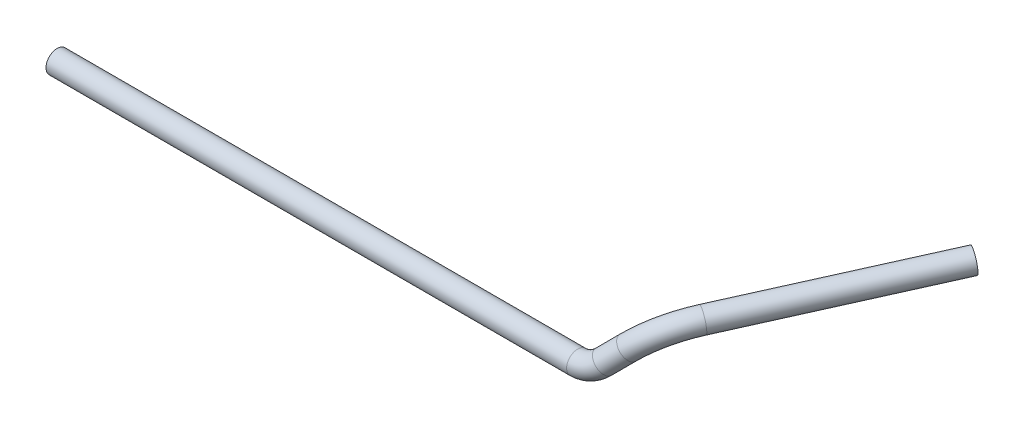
ISO-10303-21;
HEADER;
FILE_DESCRIPTION(('STEP AP214'),'2;1');
FILE_NAME('part.step','',(''),(''),'','','');
FILE_SCHEMA(('AUTOMOTIVE_DESIGN { 1 0 10303 214 1 1 1 1 }'));
ENDSEC;
DATA;
#1=APPLICATION_CONTEXT('core data for automotive mechanical design processes');
#2=APPLICATION_PROTOCOL_DEFINITION('international standard','automotive_design',2000,#1);
#3=PRODUCT_CONTEXT('',#1,'mechanical');
#4=PRODUCT('Part','Part','',(#3));
#5=PRODUCT_RELATED_PRODUCT_CATEGORY('part','',(#4));
#6=PRODUCT_DEFINITION_FORMATION('','',#4);
#7=PRODUCT_DEFINITION_CONTEXT('part definition',#1,'design');
#8=PRODUCT_DEFINITION('design','',#6,#7);
#9=PRODUCT_DEFINITION_SHAPE('','',#8);
#10=(LENGTH_UNIT() NAMED_UNIT(*) SI_UNIT(.MILLI.,.METRE.));
#11=(NAMED_UNIT(*) PLANE_ANGLE_UNIT() SI_UNIT($,.RADIAN.));
#12=(NAMED_UNIT(*) SI_UNIT($,.STERADIAN.) SOLID_ANGLE_UNIT());
#13=UNCERTAINTY_MEASURE_WITH_UNIT(LENGTH_MEASURE(1.E-05),#10,'distance_accuracy_value','');
#14=(GEOMETRIC_REPRESENTATION_CONTEXT(3) GLOBAL_UNCERTAINTY_ASSIGNED_CONTEXT((#13)) GLOBAL_UNIT_ASSIGNED_CONTEXT((#10,
#11,#12)) REPRESENTATION_CONTEXT('',''));
#15=CARTESIAN_POINT('',(0.,0.,0.));
#16=DIRECTION('',(0.,0.,1.));
#17=DIRECTION('',(1.,0.,0.));
#18=AXIS2_PLACEMENT_3D('',#15,#16,#17);
#19=CARTESIAN_POINT('',(-36.7615756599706,-6.5249361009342,60.8326028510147));
#20=DIRECTION('',(0.515038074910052,0.0914158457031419,-0.852278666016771));
#21=DIRECTION('',(-0.855862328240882,0.,-0.51720370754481));
#22=AXIS2_PLACEMENT_3D('',#19,#20,#21);
#23=CYLINDRICAL_SURFACE('',#22,4.00000000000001);
#24=CARTESIAN_POINT('',(-36.7615756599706,-6.5249361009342,60.8326028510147));
#25=DIRECTION('',(0.515038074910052,0.0914158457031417,-0.852278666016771));
#26=DIRECTION('',(-0.761187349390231,-0.408392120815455,-0.503795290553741));
#27=AXIS2_PLACEMENT_3D('',#24,#25,#26);
#28=CIRCLE('',#27,4.00000000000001);
#29=CARTESIAN_POINT('',(-35.0551746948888,-3.18464216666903,62.2220747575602));
#30=VERTEX_POINT('',#29);
#31=EDGE_CURVE('E390',#30,#30,#28,.T.);
#32=ORIENTED_EDGE('',*,*,#31,.T.);
#33=EDGE_LOOP('',(#32));
#34=FACE_BOUND('',#33,.T.);
#35=CARTESIAN_POINT('',(0.,0.,0.));
#36=DIRECTION('',(0.515038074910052,0.0914158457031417,-0.852278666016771));
#37=DIRECTION('',(-0.761187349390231,-0.408392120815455,-0.503795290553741));
#38=AXIS2_PLACEMENT_3D('',#35,#36,#37);
#39=CIRCLE('',#38,4.00000000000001);
#40=CARTESIAN_POINT('',(-3.04474939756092,-1.63356848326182,-2.01518116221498));
#41=VERTEX_POINT('',#40);
#42=EDGE_CURVE('E10',#41,#41,#39,.T.);
#43=ORIENTED_EDGE('',*,*,#42,.F.);
#44=EDGE_LOOP('',(#43));
#45=FACE_BOUND('',#44,.T.);
#46=ADVANCED_FACE('F380',(#34,#45),#23,.T.);
#47=CARTESIAN_POINT('',(-36.7615756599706,-6.5249361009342,60.8326028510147));
#48=DIRECTION('',(0.515038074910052,0.0914158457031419,-0.852278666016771));
#49=DIRECTION('',(-0.855862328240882,0.,-0.51720370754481));
#50=AXIS2_PLACEMENT_3D('',#47,#48,#49);
#51=CYLINDRICAL_SURFACE('',#50,3.00000000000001);
#52=CARTESIAN_POINT('',(-36.7615756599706,-6.5249361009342,60.8326028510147));
#53=DIRECTION('',(0.515038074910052,0.0914158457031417,-0.852278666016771));
#54=DIRECTION('',(-0.761187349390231,-0.408392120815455,-0.503795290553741));
#55=AXIS2_PLACEMENT_3D('',#52,#53,#54);
#56=CIRCLE('',#55,3.00000000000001);
#57=CARTESIAN_POINT('',(-35.4817749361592,-4.01971565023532,61.8747067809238));
#58=VERTEX_POINT('',#57);
#59=EDGE_CURVE('E394',#58,#58,#56,.T.);
#60=ORIENTED_EDGE('',*,*,#59,.F.);
#61=EDGE_LOOP('',(#60));
#62=FACE_BOUND('',#61,.T.);
#63=CARTESIAN_POINT('',(0.,0.,0.));
#64=DIRECTION('',(0.515038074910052,0.0914158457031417,-0.852278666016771));
#65=DIRECTION('',(-0.761187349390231,-0.408392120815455,-0.503795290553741));
#66=AXIS2_PLACEMENT_3D('',#63,#64,#65);
#67=CIRCLE('',#66,3.00000000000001);
#68=CARTESIAN_POINT('',(-2.28356204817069,-1.22517636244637,-1.51138587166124));
#69=VERTEX_POINT('',#68);
#70=EDGE_CURVE('E386',#69,#69,#67,.T.);
#71=ORIENTED_EDGE('',*,*,#70,.T.);
#72=EDGE_LOOP('',(#71));
#73=FACE_BOUND('',#72,.T.);
#74=ADVANCED_FACE('F444',(#62,#73),#51,.F.);
#75=CARTESIAN_POINT('',(-48.1175057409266,-28.754262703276,51.5858043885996));
#76=DIRECTION('',(-0.743470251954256,0.542490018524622,-0.391096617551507));
#77=DIRECTION('',(-0.589439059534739,-0.807812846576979,0.));
#78=AXIS2_PLACEMENT_3D('',#75,#76,#77);
#79=TOROIDAL_SURFACE('',#78,26.6196053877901,4.00000000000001);
#80=CARTESIAN_POINT('',(-50.209665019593,-15.1816506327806,74.3895422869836));
#81=DIRECTION('',(0.66413467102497,0.667633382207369,-0.336438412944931));
#82=DIRECTION('',(-0.336438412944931,-0.13497556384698,-0.931982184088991));
#83=AXIS2_PLACEMENT_3D('',#80,#81,#82);
#84=CIRCLE('',#83,4.00000000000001);
#85=CARTESIAN_POINT('',(-50.5240437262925,-13.1421595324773,77.8161502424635));
#86=VERTEX_POINT('',#85);
#87=EDGE_CURVE('E399',#86,#86,#84,.T.);
#88=CARTESIAN_POINT('',(-48.1175057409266,-28.754262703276,51.5858043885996));
#89=DIRECTION('',(-0.743470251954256,0.542490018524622,-0.391096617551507));
#90=DIRECTION('',(-0.589439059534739,-0.807812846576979,0.));
#91=AXIS2_PLACEMENT_3D('',#88,#89,#90);
#92=CIRCLE('',#91,30.6196053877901);
#93=EDGE_CURVE('',#86,#30,#92,.T.);
#94=ORIENTED_EDGE('',*,*,#87,.T.);
#95=ORIENTED_EDGE('',*,*,#31,.F.);
#96=ORIENTED_EDGE('',*,*,#93,.T.);
#97=ORIENTED_EDGE('',*,*,#93,.F.);
#98=EDGE_LOOP('',(#94,#96,#95,#97));
#99=FACE_BOUND('',#98,.T.);
#100=ADVANCED_FACE('F449',(#99),#79,.T.);
#101=CARTESIAN_POINT('',(-48.1175057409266,-28.754262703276,51.5858043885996));
#102=DIRECTION('',(-0.743470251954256,0.542490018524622,-0.391096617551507));
#103=DIRECTION('',(-0.589439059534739,-0.807812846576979,0.));
#104=AXIS2_PLACEMENT_3D('',#101,#102,#103);
#105=TOROIDAL_SURFACE('',#104,26.6196053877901,3.00000000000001);
#106=CARTESIAN_POINT('',(-50.209665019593,-15.1816506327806,74.3895422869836));
#107=DIRECTION('',(0.66413467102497,0.667633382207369,-0.336438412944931));
#108=DIRECTION('',(-0.336438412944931,-0.13497556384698,-0.931982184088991));
#109=AXIS2_PLACEMENT_3D('',#106,#107,#108);
#110=CIRCLE('',#109,3.00000000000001);
#111=CARTESIAN_POINT('',(-50.4454490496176,-13.6520323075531,76.9594982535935));
#112=VERTEX_POINT('',#111);
#113=EDGE_CURVE('E402',#112,#112,#110,.T.);
#114=CARTESIAN_POINT('',(-48.1175057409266,-28.754262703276,51.5858043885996));
#115=DIRECTION('',(-0.743470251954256,0.542490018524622,-0.391096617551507));
#116=DIRECTION('',(-0.589439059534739,-0.807812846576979,0.));
#117=AXIS2_PLACEMENT_3D('',#114,#115,#116);
#118=CIRCLE('',#117,29.6196053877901);
#119=EDGE_CURVE('',#112,#58,#118,.T.);
#120=ORIENTED_EDGE('',*,*,#113,.F.);
#121=ORIENTED_EDGE('',*,*,#59,.T.);
#122=ORIENTED_EDGE('',*,*,#119,.T.);
#123=ORIENTED_EDGE('',*,*,#119,.F.);
#124=EDGE_LOOP('',(#120,#122,#121,#123));
#125=FACE_BOUND('',#124,.T.);
#126=ADVANCED_FACE('F455',(#125),#105,.F.);
#127=CARTESIAN_POINT('',(-55.9942876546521,-20.9967470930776,77.3199257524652));
#128=DIRECTION('',(0.664134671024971,0.667633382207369,-0.336438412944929));
#129=DIRECTION('',(-0.708961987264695,0.705246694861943,0.));
#130=AXIS2_PLACEMENT_3D('',#127,#128,#129);
#131=CYLINDRICAL_SURFACE('',#130,4.00000000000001);
#132=CARTESIAN_POINT('',(-55.9942876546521,-20.9967470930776,77.3199257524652));
#133=DIRECTION('',(0.66413467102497,0.667633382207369,-0.336438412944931));
#134=DIRECTION('',(-0.336438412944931,-0.13497556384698,-0.931982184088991));
#135=AXIS2_PLACEMENT_3D('',#132,#133,#134);
#136=CIRCLE('',#135,4.00000000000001);
#137=CARTESIAN_POINT('',(-53.0038358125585,-23.3690894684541,78.5154128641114));
#138=VERTEX_POINT('',#137);
#139=EDGE_CURVE('E405',#138,#138,#136,.T.);
#140=ORIENTED_EDGE('',*,*,#139,.T.);
#141=EDGE_LOOP('',(#140));
#142=FACE_BOUND('',#141,.T.);
#143=ORIENTED_EDGE('',*,*,#87,.F.);
#144=EDGE_LOOP('',(#143));
#145=FACE_BOUND('',#144,.T.);
#146=ADVANCED_FACE('F461',(#142,#145),#131,.T.);
#147=CARTESIAN_POINT('',(-55.9942876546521,-20.9967470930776,77.3199257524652));
#148=DIRECTION('',(0.664134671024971,0.667633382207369,-0.336438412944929));
#149=DIRECTION('',(-0.708961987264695,0.705246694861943,0.));
#150=AXIS2_PLACEMENT_3D('',#147,#148,#149);
#151=CYLINDRICAL_SURFACE('',#150,3.00000000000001);
#152=CARTESIAN_POINT('',(-55.9942876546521,-20.9967470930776,77.3199257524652));
#153=DIRECTION('',(0.66413467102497,0.667633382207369,-0.336438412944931));
#154=DIRECTION('',(-0.336438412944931,-0.13497556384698,-0.931982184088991));
#155=AXIS2_PLACEMENT_3D('',#152,#153,#154);
#156=CIRCLE('',#155,3.00000000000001);
#157=CARTESIAN_POINT('',(-53.7514487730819,-22.7760038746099,78.2165410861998));
#158=VERTEX_POINT('',#157);
#159=EDGE_CURVE('E408',#158,#158,#156,.T.);
#160=ORIENTED_EDGE('',*,*,#159,.F.);
#161=EDGE_LOOP('',(#160));
#162=FACE_BOUND('',#161,.T.);
#163=ORIENTED_EDGE('',*,*,#113,.T.);
#164=EDGE_LOOP('',(#163));
#165=FACE_BOUND('',#164,.T.);
#166=ADVANCED_FACE('F467',(#162,#165),#151,.F.);
#167=CARTESIAN_POINT('',(-63.7249517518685,-14.8639675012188,74.2294532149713));
#168=DIRECTION('',(0.,0.450016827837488,0.893020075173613));
#169=DIRECTION('',(0.,-0.893020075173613,0.450016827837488));
#170=AXIS2_PLACEMENT_3D('',#167,#168,#169);
#171=TOROIDAL_SURFACE('',#170,10.3404629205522,4.00000000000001);
#172=CARTESIAN_POINT('',(-63.7249517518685,-24.0982084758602,78.8828355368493));
#173=DIRECTION('',(1.,0.,0.));
#174=DIRECTION('',(0.,0.,-1.));
#175=AXIS2_PLACEMENT_3D('',#172,#173,#174);
#176=CIRCLE('',#175,4.00000000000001);
#177=CARTESIAN_POINT('',(-63.7249517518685,-27.6702887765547,80.6829028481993));
#178=VERTEX_POINT('',#177);
#179=EDGE_CURVE('E411',#178,#178,#176,.T.);
#180=CARTESIAN_POINT('',(-63.7249517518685,-14.8639675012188,74.2294532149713));
#181=DIRECTION('',(0.,0.450016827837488,0.893020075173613));
#182=DIRECTION('',(0.,-0.893020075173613,0.450016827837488));
#183=AXIS2_PLACEMENT_3D('',#180,#181,#182);
#184=CIRCLE('',#183,14.3404629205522);
#185=EDGE_CURVE('',#178,#138,#184,.T.);
#186=ORIENTED_EDGE('',*,*,#179,.T.);
#187=ORIENTED_EDGE('',*,*,#139,.F.);
#188=ORIENTED_EDGE('',*,*,#185,.T.);
#189=ORIENTED_EDGE('',*,*,#185,.F.);
#190=EDGE_LOOP('',(#186,#188,#187,#189));
#191=FACE_BOUND('',#190,.T.);
#192=ADVANCED_FACE('F440',(#191),#171,.T.);
#193=CARTESIAN_POINT('',(-63.7249517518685,-14.8639675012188,74.2294532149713));
#194=DIRECTION('',(0.,0.450016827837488,0.893020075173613));
#195=DIRECTION('',(0.,-0.893020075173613,0.450016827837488));
#196=AXIS2_PLACEMENT_3D('',#193,#194,#195);
#197=TOROIDAL_SURFACE('',#196,10.3404629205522,3.00000000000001);
#198=CARTESIAN_POINT('',(-63.7249517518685,-24.0982084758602,78.8828355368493));
#199=DIRECTION('',(1.,0.,0.));
#200=DIRECTION('',(0.,0.,-1.));
#201=AXIS2_PLACEMENT_3D('',#198,#199,#200);
#202=CIRCLE('',#201,3.00000000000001);
#203=CARTESIAN_POINT('',(-63.7249517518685,-26.7772687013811,80.2328860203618));
#204=VERTEX_POINT('',#203);
#205=EDGE_CURVE('E414',#204,#204,#202,.T.);
#206=CARTESIAN_POINT('',(-63.7249517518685,-14.8639675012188,74.2294532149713));
#207=DIRECTION('',(0.,0.450016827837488,0.893020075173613));
#208=DIRECTION('',(0.,-0.893020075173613,0.450016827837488));
#209=AXIS2_PLACEMENT_3D('',#206,#207,#208);
#210=CIRCLE('',#209,13.3404629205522);
#211=EDGE_CURVE('',#204,#158,#210,.T.);
#212=ORIENTED_EDGE('',*,*,#205,.F.);
#213=ORIENTED_EDGE('',*,*,#159,.T.);
#214=ORIENTED_EDGE('',*,*,#211,.T.);
#215=ORIENTED_EDGE('',*,*,#211,.F.);
#216=EDGE_LOOP('',(#212,#214,#213,#215));
#217=FACE_BOUND('',#216,.T.);
#218=ADVANCED_FACE('F430',(#217),#197,.F.);
#219=CARTESIAN_POINT('',(-63.7249517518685,-24.0982084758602,78.8828355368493));
#220=DIRECTION('',(-1.,0.,0.));
#221=DIRECTION('',(0.,0.,1.));
#222=AXIS2_PLACEMENT_3D('',#219,#220,#221);
#223=CYLINDRICAL_SURFACE('',#222,3.00000000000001);
#224=ORIENTED_EDGE('',*,*,#205,.T.);
#225=EDGE_LOOP('',(#224));
#226=FACE_BOUND('',#225,.T.);
#227=CARTESIAN_POINT('',(-251.068191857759,-24.0982084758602,78.8828355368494));
#228=DIRECTION('',(1.,0.,0.));
#229=DIRECTION('',(0.,0.,-1.));
#230=AXIS2_PLACEMENT_3D('',#227,#228,#229);
#231=CIRCLE('',#230,3.00000000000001);
#232=CARTESIAN_POINT('',(-251.068191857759,-24.0982084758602,75.8828355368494));
#233=VERTEX_POINT('',#232);
#234=EDGE_CURVE('E420',#233,#233,#231,.T.);
#235=ORIENTED_EDGE('',*,*,#234,.F.);
#236=EDGE_LOOP('',(#235));
#237=FACE_BOUND('',#236,.T.);
#238=ADVANCED_FACE('F427',(#226,#237),#223,.F.);
#239=CARTESIAN_POINT('',(-63.7249517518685,-24.0982084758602,78.8828355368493));
#240=DIRECTION('',(-1.,0.,0.));
#241=DIRECTION('',(0.,0.,1.));
#242=AXIS2_PLACEMENT_3D('',#239,#240,#241);
#243=CYLINDRICAL_SURFACE('',#242,4.00000000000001);
#244=ORIENTED_EDGE('',*,*,#179,.F.);
#245=EDGE_LOOP('',(#244));
#246=FACE_BOUND('',#245,.T.);
#247=CARTESIAN_POINT('',(-251.068191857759,-24.0982084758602,78.8828355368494));
#248=DIRECTION('',(1.,0.,0.));
#249=DIRECTION('',(0.,0.,-1.));
#250=AXIS2_PLACEMENT_3D('',#247,#248,#249);
#251=CIRCLE('',#250,4.00000000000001);
#252=CARTESIAN_POINT('',(-251.068191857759,-24.0982084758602,74.8828355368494));
#253=VERTEX_POINT('',#252);
#254=EDGE_CURVE('E417',#253,#253,#251,.T.);
#255=ORIENTED_EDGE('',*,*,#254,.T.);
#256=EDGE_LOOP('',(#255));
#257=FACE_BOUND('',#256,.T.);
#258=ADVANCED_FACE('F429',(#246,#257),#243,.T.);
#259=CARTESIAN_POINT('',(0.,0.,0.));
#260=DIRECTION('',(0.515038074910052,0.0914158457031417,-0.852278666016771));
#261=DIRECTION('',(-0.761187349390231,-0.408392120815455,-0.503795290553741));
#262=AXIS2_PLACEMENT_3D('',#259,#260,#261);
#263=PLANE('',#262);
#264=ORIENTED_EDGE('',*,*,#70,.F.);
#265=EDGE_LOOP('',(#264));
#266=FACE_BOUND('',#265,.T.);
#267=ORIENTED_EDGE('',*,*,#42,.T.);
#268=EDGE_LOOP('',(#267));
#269=FACE_BOUND('',#268,.T.);
#270=ADVANCED_FACE('F437',(#266,#269),#263,.T.);
#271=CARTESIAN_POINT('',(-251.068191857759,-24.0982084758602,78.8828355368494));
#272=DIRECTION('',(1.,0.,0.));
#273=DIRECTION('',(0.,0.,-1.));
#274=AXIS2_PLACEMENT_3D('',#271,#272,#273);
#275=PLANE('',#274);
#276=ORIENTED_EDGE('',*,*,#234,.T.);
#277=EDGE_LOOP('',(#276));
#278=FACE_BOUND('',#277,.T.);
#279=ORIENTED_EDGE('',*,*,#254,.F.);
#280=EDGE_LOOP('',(#279));
#281=FACE_BOUND('',#280,.T.);
#282=ADVANCED_FACE('F424',(#278,#281),#275,.F.);
#283=CLOSED_SHELL('',(#46,#74,#100,#126,#146,#166,#192,#218,#238,#258,#270,#282));
#284=MANIFOLD_SOLID_BREP('B2',#283);
#285=ADVANCED_BREP_SHAPE_REPRESENTATION('',(#18,#284),#14);
#286=SHAPE_DEFINITION_REPRESENTATION(#9,#285);
ENDSEC;
END-ISO-10303-21;
